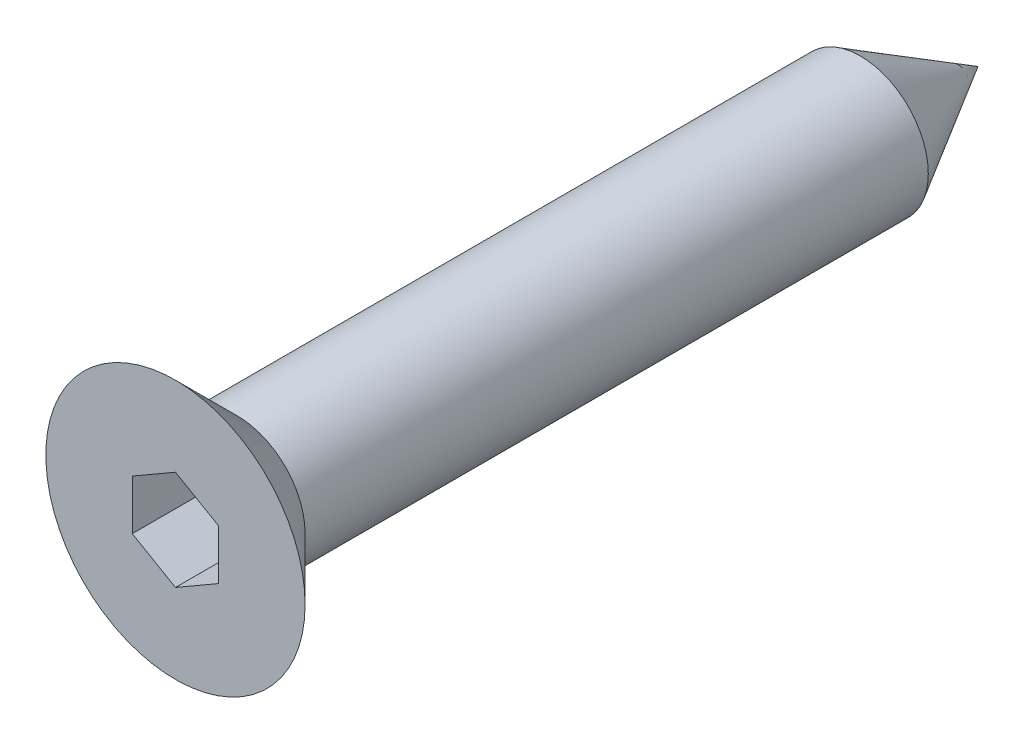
from build123d import *

# Parameters (mm, degrees)
ESQUISSE3_R             = 1.1
EXTRUSION1_DEPTH        = 13
ENL_V_MAT_EXTRU_2_DEPTH = 1.5
CHANFREIN1_SIZE         = 1.1
CHANFREIN1_SIZE2        = 1.905255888


with BuildPart() as part:
    # Esquisse1 → R_volution2 (revolve)
    with BuildSketch(Plane(origin=(0, 0, 0), x_dir=(0, 0, -1), z_dir=(1, 0, 0)), mode=Mode.PRIVATE) as r_volution2_sk:
        Polygon((0, 2.1), (1, 1.1), (1, 0), (0, 0), align=None)
    revolve(r_volution2_sk.sketch.rotate(Axis((0, 0, 1.603508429), (0, 0, -1)), 90), axis=Axis((0, 0, 1.603508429), (0, 0, -1)))

    # Esquisse3 → Extrusion1 (add)
    with BuildSketch(Plane.XY):
        Circle(ESQUISSE3_R)
    extrude(amount=-EXTRUSION1_DEPTH)

    # Esquisse2 → Enl_v. mat.-Extru.2 (cut)
    with BuildSketch(Plane.XY):
        Polygon((0, 0.808290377), (-0.7, 0.404145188), (-0.7, -0.404145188), (0, -0.808290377), (0.7, -0.404145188), (0.7, 0.404145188), align=None)
    extrude(amount=-ENL_V_MAT_EXTRU_2_DEPTH, mode=Mode.SUBTRACT)

    # Chanfrein1
    chanfrein1_edges = [part.edges().sort_by_distance(p)[0] for p in [
        (-1.1, 0, -13),
    ]]
    chanfrein1_side = [part.faces().sort_by_distance(p)[0] for p in [
        (0, 0, -13),
    ]]
    chamfer(chanfrein1_edges, length=CHANFREIN1_SIZE, length2=CHANFREIN1_SIZE2, reference=chanfrein1_side[0])


solid = part.part
